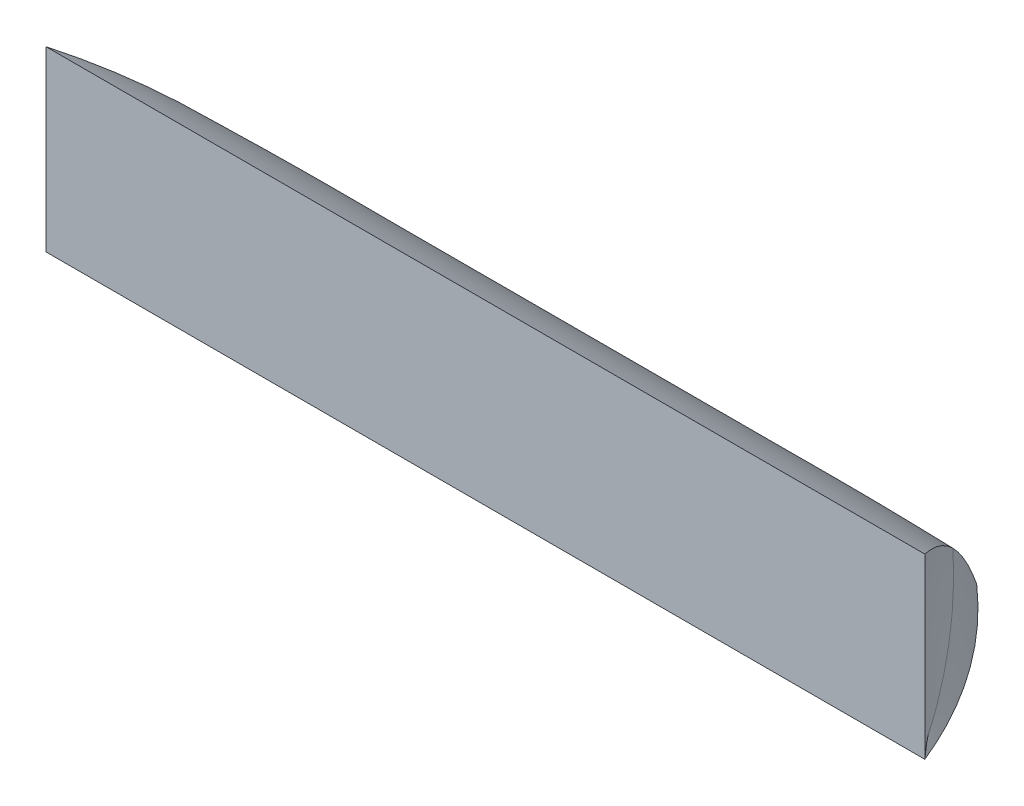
ISO-10303-21;
HEADER;
FILE_DESCRIPTION(('STEP AP214'),'2;1');
FILE_NAME('part.step','',(''),(''),'','','');
FILE_SCHEMA(('AUTOMOTIVE_DESIGN { 1 0 10303 214 1 1 1 1 }'));
ENDSEC;
DATA;
#1=APPLICATION_CONTEXT('core data for automotive mechanical design processes');
#2=APPLICATION_PROTOCOL_DEFINITION('international standard','automotive_design',2000,#1);
#3=PRODUCT_CONTEXT('',#1,'mechanical');
#4=PRODUCT('Part','Part','',(#3));
#5=PRODUCT_RELATED_PRODUCT_CATEGORY('part','',(#4));
#6=PRODUCT_DEFINITION_FORMATION('','',#4);
#7=PRODUCT_DEFINITION_CONTEXT('part definition',#1,'design');
#8=PRODUCT_DEFINITION('design','',#6,#7);
#9=PRODUCT_DEFINITION_SHAPE('','',#8);
#10=(LENGTH_UNIT() NAMED_UNIT(*) SI_UNIT(.MILLI.,.METRE.));
#11=(NAMED_UNIT(*) PLANE_ANGLE_UNIT() SI_UNIT($,.RADIAN.));
#12=(NAMED_UNIT(*) SI_UNIT($,.STERADIAN.) SOLID_ANGLE_UNIT());
#13=UNCERTAINTY_MEASURE_WITH_UNIT(LENGTH_MEASURE(1.E-05),#10,'distance_accuracy_value','');
#14=(GEOMETRIC_REPRESENTATION_CONTEXT(3) GLOBAL_UNCERTAINTY_ASSIGNED_CONTEXT((#13)) GLOBAL_UNIT_ASSIGNED_CONTEXT((#10,
#11,#12)) REPRESENTATION_CONTEXT('',''));
#15=CARTESIAN_POINT('',(0.,0.,0.));
#16=DIRECTION('',(0.,0.,1.));
#17=DIRECTION('',(1.,0.,0.));
#18=AXIS2_PLACEMENT_3D('',#15,#16,#17);
#19=CARTESIAN_POINT('',(0.,0.,-44.5));
#20=DIRECTION('',(0.,1.,0.));
#21=DIRECTION('',(0.,0.,1.));
#22=AXIS2_PLACEMENT_3D('',#19,#20,#21);
#23=PLANE('',#22);
#24=DIRECTION('',(1.,0.,0.));
#25=VECTOR('',#24,1.);
#26=CARTESIAN_POINT('',(0.,0.,-50.5));
#27=LINE('',#26,#25);
#28=CARTESIAN_POINT('',(5.29150262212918,0.,-50.5));
#29=VERTEX_POINT('',#28);
#30=CARTESIAN_POINT('',(-5.29150262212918,0.,-50.5));
#31=VERTEX_POINT('',#30);
#32=EDGE_CURVE('E160',#29,#31,#27,.F.);
#33=ORIENTED_EDGE('',*,*,#32,.F.);
#34=CARTESIAN_POINT('',(5.29150262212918,0.,-50.5));
#35=CARTESIAN_POINT('',(5.45780435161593,0.,-50.3533695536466));
#36=CARTESIAN_POINT('',(5.61798312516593,0.,-50.1997843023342));
#37=CARTESIAN_POINT('',(5.92500439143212,0.,-49.8799003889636));
#38=CARTESIAN_POINT('',(6.07185066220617,0.,-49.7136053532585));
#39=CARTESIAN_POINT('',(6.33509482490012,0.,-49.3892711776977));
#40=CARTESIAN_POINT('',(6.45305092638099,0.,-49.2324935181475));
#41=CARTESIAN_POINT('',(6.67712869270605,0.,-48.9107034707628));
#42=CARTESIAN_POINT('',(6.78325090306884,0.,-48.7456914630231));
#43=CARTESIAN_POINT('',(6.98532455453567,0.,-48.4045326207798));
#44=CARTESIAN_POINT('',(7.08099466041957,0.,-48.2282190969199));
#45=CARTESIAN_POINT('',(7.25884893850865,0.,-47.8688839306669));
#46=CARTESIAN_POINT('',(7.34103108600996,0.,-47.6858612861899));
#47=CARTESIAN_POINT('',(7.41619848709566,0.,-47.5));
#48=B_SPLINE_CURVE_WITH_KNOTS('',3,(#34,#35,#36,#37,#38,#39,#40,#41,#42,#43,#44,#45,#46,#47),
.UNSPECIFIED.,.F.,.F.,(4,2,2,2,2,2,4),(0.,0.664964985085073,1.32974094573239,1.91780985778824,
2.50585164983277,3.10707590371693,3.70839032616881),.UNSPECIFIED.);
#49=CARTESIAN_POINT('',(7.41619848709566,0.,-47.5));
#50=VERTEX_POINT('',#49);
#51=EDGE_CURVE('E161',#29,#50,#48,.T.);
#52=ORIENTED_EDGE('',*,*,#51,.T.);
#53=DIRECTION('',(-1.,0.,0.));
#54=VECTOR('',#53,1.);
#55=CARTESIAN_POINT('',(-25.,0.,-47.5));
#56=LINE('',#55,#54);
#57=CARTESIAN_POINT('',(-7.41619848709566,0.,-47.5));
#58=VERTEX_POINT('',#57);
#59=EDGE_CURVE('E285',#50,#58,#56,.T.);
#60=ORIENTED_EDGE('',*,*,#59,.T.);
#61=CARTESIAN_POINT('',(-5.29150262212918,0.,-50.5));
#62=CARTESIAN_POINT('',(-5.45780435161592,0.,-50.3533695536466));
#63=CARTESIAN_POINT('',(-5.6179831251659,0.,-50.1997843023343));
#64=CARTESIAN_POINT('',(-5.92500439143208,0.,-49.8799003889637));
#65=CARTESIAN_POINT('',(-6.07185066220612,0.,-49.7136053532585));
#66=CARTESIAN_POINT('',(-6.33509482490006,0.,-49.3892711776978));
#67=CARTESIAN_POINT('',(-6.45305092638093,0.,-49.2324935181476));
#68=CARTESIAN_POINT('',(-6.67712869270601,0.,-48.9107034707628));
#69=CARTESIAN_POINT('',(-6.78325090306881,0.,-48.7456914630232));
#70=CARTESIAN_POINT('',(-6.98532455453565,0.,-48.4045326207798));
#71=CARTESIAN_POINT('',(-7.08099466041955,0.,-48.2282190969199));
#72=CARTESIAN_POINT('',(-7.25884893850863,0.,-47.8688839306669));
#73=CARTESIAN_POINT('',(-7.34103108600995,0.,-47.6858612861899));
#74=CARTESIAN_POINT('',(-7.41619848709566,0.,-47.5));
#75=B_SPLINE_CURVE_WITH_KNOTS('',3,(#61,#62,#63,#64,#65,#66,#67,#68,#69,#70,#71,#72,#73,#74),
.UNSPECIFIED.,.F.,.F.,(4,2,2,2,2,2,4),(0.,0.664964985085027,1.32974094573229,1.91780985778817,
2.50585164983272,3.1070759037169,3.7083903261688),.UNSPECIFIED.);
#76=EDGE_CURVE('E163',#31,#58,#75,.T.);
#77=ORIENTED_EDGE('',*,*,#76,.F.);
#78=EDGE_LOOP('',(#33,#52,#60,#77));
#79=FACE_BOUND('',#78,.T.);
#80=ADVANCED_FACE('F101',(#79),#23,.F.);
#81=CARTESIAN_POINT('',(5.29150262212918,0.,-50.5));
#82=CARTESIAN_POINT('',(5.60199720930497,0.,-50.2261695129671));
#83=CARTESIAN_POINT('',(6.17765004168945,0.,-49.6328035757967));
#84=CARTESIAN_POINT('',(6.89229475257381,0.,-48.6237489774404));
#85=CARTESIAN_POINT('',(7.26095119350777,0.,-47.8837815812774));
#86=CARTESIAN_POINT('',(7.41619848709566,0.,-47.5));
#87=CARTESIAN_POINT('',(5.57971652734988,0.621275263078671,-50.093051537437));
#88=CARTESIAN_POINT('',(5.83884368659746,0.56612945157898,-49.8645228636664));
#89=CARTESIAN_POINT('',(6.31926199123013,0.455837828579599,-49.3693218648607));
#90=CARTESIAN_POINT('',(6.91567771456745,0.290400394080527,-48.5272026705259));
#91=CARTESIAN_POINT('',(7.22334457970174,0.180108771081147,-47.9096535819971));
#92=CARTESIAN_POINT('',(7.35290815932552,0.124962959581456,-47.5893638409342));
#93=CARTESIAN_POINT('',(5.90444769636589,1.18813823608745,-49.6345419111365));
#94=CARTESIAN_POINT('',(6.1118271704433,1.0774383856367,-49.4516504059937));
#95=CARTESIAN_POINT('',(6.49630595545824,0.856038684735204,-49.0553410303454));
#96=CARTESIAN_POINT('',(6.97361747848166,0.523939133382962,-48.3813930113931));
#97=CARTESIAN_POINT('',(7.21984328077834,0.302539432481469,-47.8871684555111));
#98=CARTESIAN_POINT('',(7.32353301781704,0.191839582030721,-47.6308405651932));
#99=CARTESIAN_POINT('',(6.26249579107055,1.69369025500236,-49.1289898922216));
#100=CARTESIAN_POINT('',(6.41774308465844,1.52702358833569,-48.9920746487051));
#101=CARTESIAN_POINT('',(6.70556950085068,1.19369025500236,-48.6953916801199));
#102=CARTESIAN_POINT('',(7.06289185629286,0.69369025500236,-48.1908643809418));
#103=CARTESIAN_POINT('',(7.24722007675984,0.360356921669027,-47.8208806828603));
#104=CARTESIAN_POINT('',(7.32484372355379,0.19369025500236,-47.6289898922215));
#105=(BOUNDED_SURFACE() B_SPLINE_SURFACE(3,3,((#81,#82,#83,#84,#85,#86),(#87,#88,#89,#90,#91,
#92),(#93,#94,#95,#96,#97,#98),(#99,#100,#101,#102,#103,#104)),.UNSPECIFIED.,.F.,.F.,
.F.) B_SPLINE_SURFACE_WITH_KNOTS((4,4),(4,1,1,4),(0.,0.5),(0.,0.333333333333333,
0.666666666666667,1.),
.UNSPECIFIED.) GEOMETRIC_REPRESENTATION_ITEM() RATIONAL_B_SPLINE_SURFACE(((1.,1.,1.,1.,1.,1.),
(0.99267860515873,0.99267860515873,0.99267860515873,0.99267860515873,0.99267860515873,
0.99267860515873),(0.989017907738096,0.989017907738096,0.989017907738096,0.989017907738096,
0.989017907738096,0.989017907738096),(0.989017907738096,0.989017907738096,0.989017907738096,
0.989017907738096,0.989017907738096,0.989017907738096))) REPRESENTATION_ITEM('') SURFACE());
#106=CARTESIAN_POINT('',(10.4217562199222,-7.12476848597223,-43.2562522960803));
#107=DIRECTION('',(-0.816063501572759,0.,0.577962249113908));
#108=DIRECTION('',(0.577962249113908,0.,0.816063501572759));
#109=AXIS2_PLACEMENT_3D('',#106,#107,#108);
#110=CIRCLE('',#109,11.3821662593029);
#111=CARTESIAN_POINT('',(6.26249579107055,1.69369025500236,-49.1289898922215));
#112=VERTEX_POINT('',#111);
#113=EDGE_CURVE('E127',#112,#29,#110,.T.);
#114=CARTESIAN_POINT('',(6.26249579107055,1.69369025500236,-49.1289898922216));
#115=CARTESIAN_POINT('',(6.41774308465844,1.52702358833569,-48.9920746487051));
#116=CARTESIAN_POINT('',(6.70556950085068,1.19369025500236,-48.6953916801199));
#117=CARTESIAN_POINT('',(7.06289185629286,0.69369025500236,-48.1908643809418));
#118=CARTESIAN_POINT('',(7.24722007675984,0.360356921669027,-47.8208806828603));
#119=CARTESIAN_POINT('',(7.32484372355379,0.19369025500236,-47.6289898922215));
#120=(BOUNDED_CURVE() B_SPLINE_CURVE(3,(#114,#115,#116,#117,#118,#119),.UNSPECIFIED.,.F.,
.F.) B_SPLINE_CURVE_WITH_KNOTS((4,1,1,4),(0.,0.333333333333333,0.666666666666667,1.),
.UNSPECIFIED.) CURVE() GEOMETRIC_REPRESENTATION_ITEM() RATIONAL_B_SPLINE_CURVE((0.989017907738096,
0.989017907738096,0.989017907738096,0.989017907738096,0.989017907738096,0.989017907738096)) REPRESENTATION_ITEM(''));
#121=CARTESIAN_POINT('',(7.32484372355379,0.19369025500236,-47.6289898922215));
#122=VERTEX_POINT('',#121);
#123=EDGE_CURVE('E172',#112,#122,#120,.T.);
#124=CARTESIAN_POINT('',(7.32484372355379,0.19369025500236,-47.6289898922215));
#125=CARTESIAN_POINT('',(7.32353301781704,0.191839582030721,-47.6308405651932));
#126=CARTESIAN_POINT('',(7.35290815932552,0.124962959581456,-47.5893638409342));
#127=CARTESIAN_POINT('',(7.41619848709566,0.,-47.5));
#128=(BOUNDED_CURVE() B_SPLINE_CURVE(3,(#124,#125,#126,#127),.UNSPECIFIED.,.F.,
.F.) B_SPLINE_CURVE_WITH_KNOTS((4,4),(0.,0.5),
.UNSPECIFIED.) CURVE() GEOMETRIC_REPRESENTATION_ITEM() RATIONAL_B_SPLINE_CURVE((0.989017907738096,
0.989017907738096,0.99267860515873,1.)) REPRESENTATION_ITEM(''));
#129=EDGE_CURVE('E170',#122,#50,#128,.T.);
#130=ORIENTED_EDGE('',*,*,#113,.F.);
#131=ORIENTED_EDGE('',*,*,#123,.T.);
#132=ORIENTED_EDGE('',*,*,#129,.T.);
#133=ORIENTED_EDGE('',*,*,#51,.F.);
#134=EDGE_LOOP('',(#130,#131,#132,#133));
#135=FACE_BOUND('',#134,.T.);
#136=ADVANCED_FACE('F169',(#135),#105,.T.);
#137=CARTESIAN_POINT('',(6.26249579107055,1.69369025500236,-49.1289898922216));
#138=CARTESIAN_POINT('',(6.41774308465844,1.52702358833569,-48.9920746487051));
#139=CARTESIAN_POINT('',(6.70556950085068,1.19369025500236,-48.6953916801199));
#140=CARTESIAN_POINT('',(7.06289185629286,0.69369025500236,-48.1908643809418));
#141=CARTESIAN_POINT('',(7.24722007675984,0.360356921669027,-47.8208806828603));
#142=CARTESIAN_POINT('',(7.32484372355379,0.19369025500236,-47.6289898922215));
#143=CARTESIAN_POINT('',(6.62054388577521,2.19924227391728,-48.6234378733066));
#144=CARTESIAN_POINT('',(6.72365899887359,1.97660879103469,-48.5324988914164));
#145=CARTESIAN_POINT('',(6.91483304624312,1.53134182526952,-48.3354423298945));
#146=CARTESIAN_POINT('',(7.15216623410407,0.863441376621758,-48.0003357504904));
#147=CARTESIAN_POINT('',(7.27459687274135,0.418174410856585,-47.7545929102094));
#148=CARTESIAN_POINT('',(7.32615442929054,0.195540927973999,-47.6271392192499));
#149=CARTESIAN_POINT('',(7.00662741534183,2.63602604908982,-48.0783007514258));
#150=CARTESIAN_POINT('',(7.05799484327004,2.35783852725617,-48.0329989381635));
#151=CARTESIAN_POINT('',(7.15322937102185,1.80146348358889,-47.9348339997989));
#152=CARTESIAN_POINT('',(7.27145835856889,0.966900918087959,-47.7678985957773));
#153=CARTESIAN_POINT('',(7.33244793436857,0.410525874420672,-47.6454802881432));
#154=CARTESIAN_POINT('',(7.35813164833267,0.132338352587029,-47.5819884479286));
#155=CARTESIAN_POINT('',(7.41619848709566,3.,-47.5));
#156=CARTESIAN_POINT('',(7.41619848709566,2.66666666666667,-47.5));
#157=CARTESIAN_POINT('',(7.41619848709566,2.,-47.5));
#158=CARTESIAN_POINT('',(7.41619848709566,1.,-47.5));
#159=CARTESIAN_POINT('',(7.41619848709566,0.333333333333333,-47.5));
#160=CARTESIAN_POINT('',(7.41619848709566,0.,-47.5));
#161=(BOUNDED_SURFACE() B_SPLINE_SURFACE(3,3,((#137,#138,#139,#140,#141,#142),(#143,#144,#145,
#146,#147,#148),(#149,#150,#151,#152,#153,#154),(#155,#156,#157,#158,#159,#160)),.UNSPECIFIED.,
.F.,.F.,.F.) B_SPLINE_SURFACE_WITH_KNOTS((4,4),(4,1,1,4),(0.5,1.),(0.,0.333333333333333,
0.666666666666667,1.),
.UNSPECIFIED.) GEOMETRIC_REPRESENTATION_ITEM() RATIONAL_B_SPLINE_SURFACE(((0.989017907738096,
0.989017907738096,0.989017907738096,0.989017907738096,0.989017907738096,0.989017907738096),
(0.989017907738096,0.989017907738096,0.989017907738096,0.989017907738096,0.989017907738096,
0.989017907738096),(0.99267860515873,0.99267860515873,0.99267860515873,0.99267860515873,
0.99267860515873,0.99267860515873),(1.,1.,1.,1.,1.,1.))) REPRESENTATION_ITEM('') SURFACE());
#162=CARTESIAN_POINT('',(10.4217562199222,-7.12476848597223,-43.2562522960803));
#163=DIRECTION('',(-0.816063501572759,0.,0.577962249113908));
#164=DIRECTION('',(0.577962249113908,0.,0.816063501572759));
#165=AXIS2_PLACEMENT_3D('',#162,#163,#164);
#166=CIRCLE('',#165,11.3821662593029);
#167=CARTESIAN_POINT('',(7.41619848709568,3.,-47.5));
#168=VERTEX_POINT('',#167);
#169=EDGE_CURVE('E154',#168,#112,#166,.T.);
#170=DIRECTION('',(0.,1.,0.));
#171=VECTOR('',#170,1.);
#172=CARTESIAN_POINT('',(7.41619848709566,370.,-47.5));
#173=LINE('',#172,#171);
#174=EDGE_CURVE('E197',#50,#168,#173,.T.);
#175=ORIENTED_EDGE('',*,*,#169,.F.);
#176=ORIENTED_EDGE('',*,*,#174,.F.);
#177=ORIENTED_EDGE('',*,*,#129,.F.);
#178=ORIENTED_EDGE('',*,*,#123,.F.);
#179=EDGE_LOOP('',(#175,#176,#177,#178));
#180=FACE_BOUND('',#179,.T.);
#181=ADVANCED_FACE('F212',(#180),#161,.T.);
#182=CARTESIAN_POINT('',(-25.,370.,-47.5));
#183=DIRECTION('',(0.,0.,1.));
#184=DIRECTION('',(1.,0.,0.));
#185=AXIS2_PLACEMENT_3D('',#182,#183,#184);
#186=PLANE('',#185);
#187=DIRECTION('',(1.,0.,0.));
#188=VECTOR('',#187,1.);
#189=CARTESIAN_POINT('',(-25.,3.,-47.5));
#190=LINE('',#189,#188);
#191=CARTESIAN_POINT('',(-7.41619848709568,3.,-47.5));
#192=VERTEX_POINT('',#191);
#193=EDGE_CURVE('E174',#192,#168,#190,.T.);
#194=ORIENTED_EDGE('',*,*,#193,.F.);
#195=DIRECTION('',(0.,1.,0.));
#196=VECTOR('',#195,1.);
#197=CARTESIAN_POINT('',(-7.41619848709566,370.,-47.5));
#198=LINE('',#197,#196);
#199=EDGE_CURVE('E167',#192,#58,#198,.F.);
#200=ORIENTED_EDGE('',*,*,#199,.T.);
#201=ORIENTED_EDGE('',*,*,#59,.F.);
#202=ORIENTED_EDGE('',*,*,#174,.T.);
#203=EDGE_LOOP('',(#194,#200,#201,#202));
#204=FACE_BOUND('',#203,.T.);
#205=ADVANCED_FACE('F298',(#204),#186,.T.);
#206=CARTESIAN_POINT('',(-5.29150262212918,0.,-50.5));
#207=CARTESIAN_POINT('',(-5.60199720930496,0.,-50.2261695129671));
#208=CARTESIAN_POINT('',(-6.17765004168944,0.,-49.6328035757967));
#209=CARTESIAN_POINT('',(-6.89229475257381,0.,-48.6237489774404));
#210=CARTESIAN_POINT('',(-7.26095119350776,0.,-47.8837815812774));
#211=CARTESIAN_POINT('',(-7.41619848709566,0.,-47.5));
#212=CARTESIAN_POINT('',(-5.57971652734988,0.621275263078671,-50.093051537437));
#213=CARTESIAN_POINT('',(-5.83884368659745,0.56612945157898,-49.8645228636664));
#214=CARTESIAN_POINT('',(-6.31926199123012,0.455837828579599,-49.3693218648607));
#215=CARTESIAN_POINT('',(-6.91567771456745,0.290400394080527,-48.5272026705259));
#216=CARTESIAN_POINT('',(-7.22334457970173,0.180108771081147,-47.9096535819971));
#217=CARTESIAN_POINT('',(-7.35290815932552,0.124962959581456,-47.5893638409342));
#218=CARTESIAN_POINT('',(-5.90444769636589,1.18813823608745,-49.6345419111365));
#219=CARTESIAN_POINT('',(-6.11182717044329,1.0774383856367,-49.4516504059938));
#220=CARTESIAN_POINT('',(-6.49630595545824,0.856038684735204,-49.0553410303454));
#221=CARTESIAN_POINT('',(-6.97361747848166,0.523939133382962,-48.3813930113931));
#222=CARTESIAN_POINT('',(-7.21984328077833,0.302539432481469,-47.8871684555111));
#223=CARTESIAN_POINT('',(-7.32353301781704,0.191839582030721,-47.6308405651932));
#224=CARTESIAN_POINT('',(-6.26249579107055,1.69369025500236,-49.1289898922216));
#225=CARTESIAN_POINT('',(-6.41774308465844,1.5270235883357,-48.9920746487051));
#226=CARTESIAN_POINT('',(-6.70556950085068,1.19369025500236,-48.6953916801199));
#227=CARTESIAN_POINT('',(-7.06289185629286,0.69369025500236,-48.1908643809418));
#228=CARTESIAN_POINT('',(-7.24722007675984,0.360356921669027,-47.8208806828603));
#229=CARTESIAN_POINT('',(-7.32484372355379,0.19369025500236,-47.6289898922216));
#230=(BOUNDED_SURFACE() B_SPLINE_SURFACE(3,3,((#206,#207,#208,#209,#210,#211),(#212,#213,#214,
#215,#216,#217),(#218,#219,#220,#221,#222,#223),(#224,#225,#226,#227,#228,#229)),.UNSPECIFIED.,
.F.,.F.,.F.) B_SPLINE_SURFACE_WITH_KNOTS((4,4),(4,1,1,4),(0.,0.5),(0.,0.333333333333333,
0.666666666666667,1.),
.UNSPECIFIED.) GEOMETRIC_REPRESENTATION_ITEM() RATIONAL_B_SPLINE_SURFACE(((1.,1.,1.,1.,1.,1.),
(0.99267860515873,0.99267860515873,0.99267860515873,0.99267860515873,0.99267860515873,
0.99267860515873),(0.989017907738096,0.989017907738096,0.989017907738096,0.989017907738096,
0.989017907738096,0.989017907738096),(0.989017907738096,0.989017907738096,0.989017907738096,
0.989017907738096,0.989017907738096,0.989017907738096))) REPRESENTATION_ITEM('') SURFACE());
#231=CARTESIAN_POINT('',(-10.4217562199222,-7.12476848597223,-43.2562522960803));
#232=DIRECTION('',(0.816063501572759,0.,0.577962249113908));
#233=DIRECTION('',(0.577962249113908,0.,-0.816063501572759));
#234=AXIS2_PLACEMENT_3D('',#231,#232,#233);
#235=CIRCLE('',#234,11.3821662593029);
#236=CARTESIAN_POINT('',(-6.26249579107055,1.69369025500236,-49.1289898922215));
#237=VERTEX_POINT('',#236);
#238=EDGE_CURVE('E118',#31,#237,#235,.T.);
#239=CARTESIAN_POINT('',(-7.32484372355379,0.19369025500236,-47.6289898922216));
#240=CARTESIAN_POINT('',(-7.32615442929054,0.195540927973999,-47.6271392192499));
#241=CARTESIAN_POINT('',(-7.35813164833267,0.132338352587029,-47.5819884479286));
#242=CARTESIAN_POINT('',(-7.41619848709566,0.,-47.5));
#243=(BOUNDED_CURVE() B_SPLINE_CURVE(3,(#239,#240,#241,#242),.UNSPECIFIED.,.F.,
.F.) B_SPLINE_CURVE_WITH_KNOTS((4,4),(0.5,1.),
.UNSPECIFIED.) CURVE() GEOMETRIC_REPRESENTATION_ITEM() RATIONAL_B_SPLINE_CURVE((0.989017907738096,
0.989017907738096,0.99267860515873,1.)) REPRESENTATION_ITEM(''));
#244=CARTESIAN_POINT('',(-7.32484372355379,0.19369025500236,-47.6289898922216));
#245=VERTEX_POINT('',#244);
#246=EDGE_CURVE('E190',#245,#58,#243,.T.);
#247=CARTESIAN_POINT('',(-6.26249579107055,1.69369025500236,-49.1289898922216));
#248=CARTESIAN_POINT('',(-6.32066001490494,1.63124883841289,-49.0776962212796));
#249=CARTESIAN_POINT('',(-6.37729099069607,1.56874335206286,-49.0247433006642));
#250=CARTESIAN_POINT('',(-6.48724749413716,1.44373225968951,-48.9157783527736));
#251=CARTESIAN_POINT('',(-6.54057791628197,1.38122679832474,-48.8597710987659));
#252=CARTESIAN_POINT('',(-6.64382065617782,1.25621606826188,-48.7448571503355));
#253=CARTESIAN_POINT('',(-6.69373632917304,1.19371086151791,-48.6859534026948));
#254=CARTESIAN_POINT('',(-6.7900389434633,1.06870051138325,-48.5654076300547));
#255=CARTESIAN_POINT('',(-6.83642761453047,1.00619538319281,-48.5037669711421));
#256=CARTESIAN_POINT('',(-6.92556510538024,0.881185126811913,-48.377907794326));
#257=CARTESIAN_POINT('',(-6.96831392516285,0.818679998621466,-48.3136892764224));
#258=CARTESIAN_POINT('',(-7.05006099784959,0.693669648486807,-48.1828348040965));
#259=CARTESIAN_POINT('',(-7.08905738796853,0.63116444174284,-48.1161976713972));
#260=CARTESIAN_POINT('',(-7.16318835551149,0.50615371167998,-47.9806658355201));
#261=CARTESIAN_POINT('',(-7.19831903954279,0.44364825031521,-47.9117689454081));
#262=CARTESIAN_POINT('',(-7.26460984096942,0.318637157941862,-47.7718785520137));
#263=CARTESIAN_POINT('',(-7.29576383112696,0.256131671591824,-47.7008820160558));
#264=CARTESIAN_POINT('',(-7.32484372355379,0.19369025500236,-47.6289898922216));
#265=B_SPLINE_CURVE_WITH_KNOTS('',3,(#247,#248,#249,#250,#251,#252,#253,#254,#255,#256,#257,
#258,#259,#260,#261,#262,#263,#264),.UNSPECIFIED.,.F.,.F.,(4,2,2,2,2,2,2,2,4),(0.,
0.298666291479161,0.596878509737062,0.894793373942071,1.19256117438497,1.49032897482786,
1.78824383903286,2.08645605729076,2.38512234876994),.UNSPECIFIED.);
#266=EDGE_CURVE('E186',#237,#245,#265,.T.);
#267=ORIENTED_EDGE('',*,*,#238,.F.);
#268=ORIENTED_EDGE('',*,*,#76,.T.);
#269=ORIENTED_EDGE('',*,*,#246,.F.);
#270=ORIENTED_EDGE('',*,*,#266,.F.);
#271=EDGE_LOOP('',(#267,#268,#269,#270));
#272=FACE_BOUND('',#271,.T.);
#273=ADVANCED_FACE('F199',(#272),#230,.F.);
#274=CARTESIAN_POINT('',(-6.26249579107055,1.69369025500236,-49.1289898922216));
#275=CARTESIAN_POINT('',(-6.41774308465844,1.5270235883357,-48.9920746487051));
#276=CARTESIAN_POINT('',(-6.70556950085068,1.19369025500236,-48.6953916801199));
#277=CARTESIAN_POINT('',(-7.06289185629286,0.69369025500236,-48.1908643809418));
#278=CARTESIAN_POINT('',(-7.24722007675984,0.360356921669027,-47.8208806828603));
#279=CARTESIAN_POINT('',(-7.32484372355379,0.19369025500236,-47.6289898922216));
#280=CARTESIAN_POINT('',(-6.62054388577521,2.19924227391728,-48.6234378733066));
#281=CARTESIAN_POINT('',(-6.72365899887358,1.97660879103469,-48.5324988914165));
#282=CARTESIAN_POINT('',(-6.91483304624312,1.53134182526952,-48.3354423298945));
#283=CARTESIAN_POINT('',(-7.15216623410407,0.863441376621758,-48.0003357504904));
#284=CARTESIAN_POINT('',(-7.27459687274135,0.418174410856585,-47.7545929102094));
#285=CARTESIAN_POINT('',(-7.32615442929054,0.195540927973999,-47.6271392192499));
#286=CARTESIAN_POINT('',(-7.00662741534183,2.63602604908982,-48.0783007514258));
#287=CARTESIAN_POINT('',(-7.05799484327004,2.35783852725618,-48.0329989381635));
#288=CARTESIAN_POINT('',(-7.15322937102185,1.80146348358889,-47.9348339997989));
#289=CARTESIAN_POINT('',(-7.27145835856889,0.966900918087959,-47.7678985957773));
#290=CARTESIAN_POINT('',(-7.33244793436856,0.410525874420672,-47.6454802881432));
#291=CARTESIAN_POINT('',(-7.35813164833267,0.132338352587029,-47.5819884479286));
#292=CARTESIAN_POINT('',(-7.41619848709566,3.,-47.5));
#293=CARTESIAN_POINT('',(-7.41619848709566,2.66666666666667,-47.5));
#294=CARTESIAN_POINT('',(-7.41619848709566,2.,-47.5));
#295=CARTESIAN_POINT('',(-7.41619848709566,1.,-47.5));
#296=CARTESIAN_POINT('',(-7.41619848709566,0.333333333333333,-47.5));
#297=CARTESIAN_POINT('',(-7.41619848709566,0.,-47.5));
#298=(BOUNDED_SURFACE() B_SPLINE_SURFACE(3,3,((#274,#275,#276,#277,#278,#279),(#280,#281,#282,
#283,#284,#285),(#286,#287,#288,#289,#290,#291),(#292,#293,#294,#295,#296,#297)),.UNSPECIFIED.,
.F.,.F.,.F.) B_SPLINE_SURFACE_WITH_KNOTS((4,4),(4,1,1,4),(0.5,1.),(0.,0.333333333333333,
0.666666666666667,1.),
.UNSPECIFIED.) GEOMETRIC_REPRESENTATION_ITEM() RATIONAL_B_SPLINE_SURFACE(((0.989017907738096,
0.989017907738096,0.989017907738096,0.989017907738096,0.989017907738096,0.989017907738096),
(0.989017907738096,0.989017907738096,0.989017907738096,0.989017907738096,0.989017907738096,
0.989017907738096),(0.99267860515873,0.99267860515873,0.99267860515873,0.99267860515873,
0.99267860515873,0.99267860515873),(1.,1.,1.,1.,1.,1.))) REPRESENTATION_ITEM('') SURFACE());
#299=CARTESIAN_POINT('',(-10.4217562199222,-7.12476848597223,-43.2562522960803));
#300=DIRECTION('',(0.816063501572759,0.,0.577962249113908));
#301=DIRECTION('',(0.577962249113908,0.,-0.816063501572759));
#302=AXIS2_PLACEMENT_3D('',#299,#300,#301);
#303=CIRCLE('',#302,11.3821662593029);
#304=EDGE_CURVE('E12',#237,#192,#303,.T.);
#305=ORIENTED_EDGE('',*,*,#304,.F.);
#306=ORIENTED_EDGE('',*,*,#266,.T.);
#307=ORIENTED_EDGE('',*,*,#246,.T.);
#308=ORIENTED_EDGE('',*,*,#199,.F.);
#309=EDGE_LOOP('',(#305,#306,#307,#308));
#310=FACE_BOUND('',#309,.T.);
#311=ADVANCED_FACE('F257',(#310),#298,.F.);
#312=CARTESIAN_POINT('',(-5.29150262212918,0.,-50.5));
#313=CARTESIAN_POINT('',(-4.85054407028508,0.,-50.5));
#314=CARTESIAN_POINT('',(-4.03058967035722,0.,-50.5));
#315=CARTESIAN_POINT('',(-3.14867256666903,0.,-50.5));
#316=CARTESIAN_POINT('',(-2.45505011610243,0.,-50.5));
#317=CARTESIAN_POINT('',(-2.09911504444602,0.,-50.5));
#318=CARTESIAN_POINT('',(-1.65815649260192,0.,-50.5));
#319=CARTESIAN_POINT('',(-1.34352989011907,0.,-50.5));
#320=CARTESIAN_POINT('',(-0.755585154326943,0.,-50.5));
#321=CARTESIAN_POINT('',(0.,0.,-50.5));
#322=CARTESIAN_POINT('',(0.755585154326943,0.,-50.5));
#323=CARTESIAN_POINT('',(1.34352989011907,0.,-50.5));
#324=CARTESIAN_POINT('',(1.65815649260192,0.,-50.5));
#325=CARTESIAN_POINT('',(2.09911504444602,0.,-50.5));
#326=CARTESIAN_POINT('',(2.45505011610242,0.,-50.5));
#327=CARTESIAN_POINT('',(3.14867256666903,0.,-50.5));
#328=CARTESIAN_POINT('',(4.03058967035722,0.,-50.5));
#329=CARTESIAN_POINT('',(4.85054407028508,0.,-50.5));
#330=CARTESIAN_POINT('',(5.29150262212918,0.,-50.5));
#331=CARTESIAN_POINT('',(-5.87221340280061,1.25178291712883,-49.680055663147));
#332=CARTESIAN_POINT('',(-5.42865373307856,1.24155514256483,-49.7078690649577));
#333=CARTESIAN_POINT('',(-4.59402753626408,1.22238968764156,-49.7599875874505));
#334=CARTESIAN_POINT('',(-3.57641892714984,1.22609831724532,-49.7499023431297));
#335=CARTESIAN_POINT('',(-2.78112968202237,1.22807404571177,-49.7445295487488));
#336=CARTESIAN_POINT('',(-2.37755636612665,1.22807182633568,-49.7445355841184));
#337=CARTESIAN_POINT('',(-1.87893157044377,1.22775952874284,-49.7453848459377));
#338=CARTESIAN_POINT('',(-1.52346834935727,1.22745989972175,-49.7461996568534));
#339=CARTESIAN_POINT('',(-0.857668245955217,1.22731642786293,-49.7465898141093));
#340=CARTESIAN_POINT('',(0.,1.22762449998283,-49.7457520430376));
#341=CARTESIAN_POINT('',(0.857668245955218,1.22731642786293,-49.7465898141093));
#342=CARTESIAN_POINT('',(1.52346834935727,1.22745989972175,-49.7461996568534));
#343=CARTESIAN_POINT('',(1.87893157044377,1.22775952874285,-49.7453848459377));
#344=CARTESIAN_POINT('',(2.37755636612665,1.22807182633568,-49.7445355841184));
#345=CARTESIAN_POINT('',(2.78112968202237,1.22807404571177,-49.7445295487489));
#346=CARTESIAN_POINT('',(3.57641892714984,1.22609831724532,-49.7499023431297));
#347=CARTESIAN_POINT('',(4.59402753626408,1.22238968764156,-49.7599875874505));
#348=CARTESIAN_POINT('',(5.42865373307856,1.24155514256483,-49.7078690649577));
#349=CARTESIAN_POINT('',(5.87221340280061,1.25178291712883,-49.680055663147));
#350=CARTESIAN_POINT('',(-6.59096995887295,2.26664330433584,-48.66519527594));
#351=CARTESIAN_POINT('',(-6.08505992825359,2.25799233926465,-48.6914318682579));
#352=CARTESIAN_POINT('',(-5.13014179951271,2.24178161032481,-48.7405956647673));
#353=CARTESIAN_POINT('',(-3.99696214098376,2.24491848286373,-48.7310821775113));
#354=CARTESIAN_POINT('',(-3.11007835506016,2.2465896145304,-48.7260139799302));
#355=CARTESIAN_POINT('',(-2.65887449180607,2.24658773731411,-48.7260196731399));
#356=CARTESIAN_POINT('',(-2.10103933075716,2.24632358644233,-48.7268207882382));
#357=CARTESIAN_POINT('',(-1.70327340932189,2.24607015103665,-48.7275894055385));
#358=CARTESIAN_POINT('',(-0.958643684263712,2.24594879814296,-48.7279574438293));
#359=CARTESIAN_POINT('',(0.,2.24620937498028,-48.7271671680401));
#360=CARTESIAN_POINT('',(0.958643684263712,2.24594879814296,-48.7279574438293));
#361=CARTESIAN_POINT('',(1.70327340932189,2.24607015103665,-48.7275894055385));
#362=CARTESIAN_POINT('',(2.10103933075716,2.24632358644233,-48.7268207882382));
#363=CARTESIAN_POINT('',(2.65887449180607,2.24658773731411,-48.7260196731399));
#364=CARTESIAN_POINT('',(3.11007835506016,2.2465896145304,-48.7260139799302));
#365=CARTESIAN_POINT('',(3.99696214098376,2.24491848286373,-48.7310821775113));
#366=CARTESIAN_POINT('',(5.13014179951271,2.24178161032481,-48.7405956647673));
#367=CARTESIAN_POINT('',(6.08505992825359,2.25799233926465,-48.6914318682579));
#368=CARTESIAN_POINT('',(6.59096995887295,2.26664330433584,-48.66519527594));
#369=CARTESIAN_POINT('',(-7.41619848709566,3.,-47.5));
#370=CARTESIAN_POINT('',(-6.79818194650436,3.,-47.5));
#371=CARTESIAN_POINT('',(-5.64899143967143,3.,-47.5));
#372=CARTESIAN_POINT('',(-4.41295835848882,3.,-47.5));
#373=CARTESIAN_POINT('',(-3.4408258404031,3.,-47.5));
#374=CARTESIAN_POINT('',(-2.94197223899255,3.,-47.5));
#375=CARTESIAN_POINT('',(-2.32395569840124,3.,-47.5));
#376=CARTESIAN_POINT('',(-1.88299714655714,3.,-47.5));
#377=CARTESIAN_POINT('',(-1.0589750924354,3.,-47.5));
#378=CARTESIAN_POINT('',(0.,3.,-47.5));
#379=CARTESIAN_POINT('',(1.0589750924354,3.,-47.5));
#380=CARTESIAN_POINT('',(1.88299714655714,3.,-47.5));
#381=CARTESIAN_POINT('',(2.32395569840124,3.,-47.5));
#382=CARTESIAN_POINT('',(2.94197223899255,3.,-47.5));
#383=CARTESIAN_POINT('',(3.4408258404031,3.,-47.5));
#384=CARTESIAN_POINT('',(4.41295835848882,3.,-47.5));
#385=CARTESIAN_POINT('',(5.64899143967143,3.,-47.5));
#386=CARTESIAN_POINT('',(6.79818194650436,3.,-47.5));
#387=CARTESIAN_POINT('',(7.41619848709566,3.,-47.5));
#388=(BOUNDED_SURFACE() B_SPLINE_SURFACE(3,3,((#312,#313,#314,#315,#316,#317,#318,#319,#320,
#321,#322,#323,#324,#325,#326,#327,#328,#329,#330),(#331,#332,#333,#334,#335,#336,#337,#338,
#339,#340,#341,#342,#343,#344,#345,#346,#347,#348,#349),(#350,#351,#352,#353,#354,#355,#356,
#357,#358,#359,#360,#361,#362,#363,#364,#365,#366,#367,#368),(#369,#370,#371,#372,#373,#374,
#375,#376,#377,#378,#379,#380,#381,#382,#383,#384,#385,#386,#387)),.UNSPECIFIED.,.F.,.F.,
.F.) B_SPLINE_SURFACE_WITH_KNOTS((4,4),(4,1,1,1,1,1,1,1,1,1,1,1,1,1,1,1,4),(0.,1.),(0.,0.125,
0.232435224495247,0.25,0.321623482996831,0.333333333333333,0.375,0.410811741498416,0.5,
0.589188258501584,0.625,0.666666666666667,0.678376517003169,0.75,0.767564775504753,0.875,1.),
.UNSPECIFIED.) GEOMETRIC_REPRESENTATION_ITEM() RATIONAL_B_SPLINE_SURFACE(((1.,1.,1.,1.,1.,1.,1.,
1.,1.,1.,1.,1.,1.,1.,1.,1.,1.,1.,1.),(0.985357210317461,0.985357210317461,0.980426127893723,
0.981376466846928,0.981883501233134,0.981882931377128,0.981802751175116,0.981725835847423,
0.981689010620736,0.981768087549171,0.981689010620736,0.981725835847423,0.981802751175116,
0.981882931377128,0.981883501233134,0.981376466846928,0.980426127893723,0.985357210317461,
0.985357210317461),(0.985357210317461,0.985357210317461,0.980426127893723,0.981376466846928,
0.981883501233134,0.981882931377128,0.981802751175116,0.981725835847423,0.981689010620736,
0.981768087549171,0.981689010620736,0.981725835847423,0.981802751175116,0.981882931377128,
0.981883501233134,0.981376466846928,0.980426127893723,0.985357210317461,0.985357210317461),(1.,
1.,1.,1.,1.,1.,1.,1.,1.,1.,1.,1.,1.,1.,1.,1.,1.,1.,1.))) REPRESENTATION_ITEM('') SURFACE());
#389=ORIENTED_EDGE('',*,*,#304,.T.);
#390=ORIENTED_EDGE('',*,*,#193,.T.);
#391=ORIENTED_EDGE('',*,*,#169,.T.);
#392=ORIENTED_EDGE('',*,*,#113,.T.);
#393=ORIENTED_EDGE('',*,*,#32,.T.);
#394=ORIENTED_EDGE('',*,*,#238,.T.);
#395=EDGE_LOOP('',(#389,#390,#391,#392,#393,#394));
#396=FACE_BOUND('',#395,.T.);
#397=ADVANCED_FACE('F103',(#396),#388,.T.);
#398=CLOSED_SHELL('',(#80,#136,#181,#205,#273,#311,#397));
#399=MANIFOLD_SOLID_BREP('B2',#398);
#400=ADVANCED_BREP_SHAPE_REPRESENTATION('',(#18,#399),#14);
#401=SHAPE_DEFINITION_REPRESENTATION(#9,#400);
ENDSEC;
END-ISO-10303-21;
